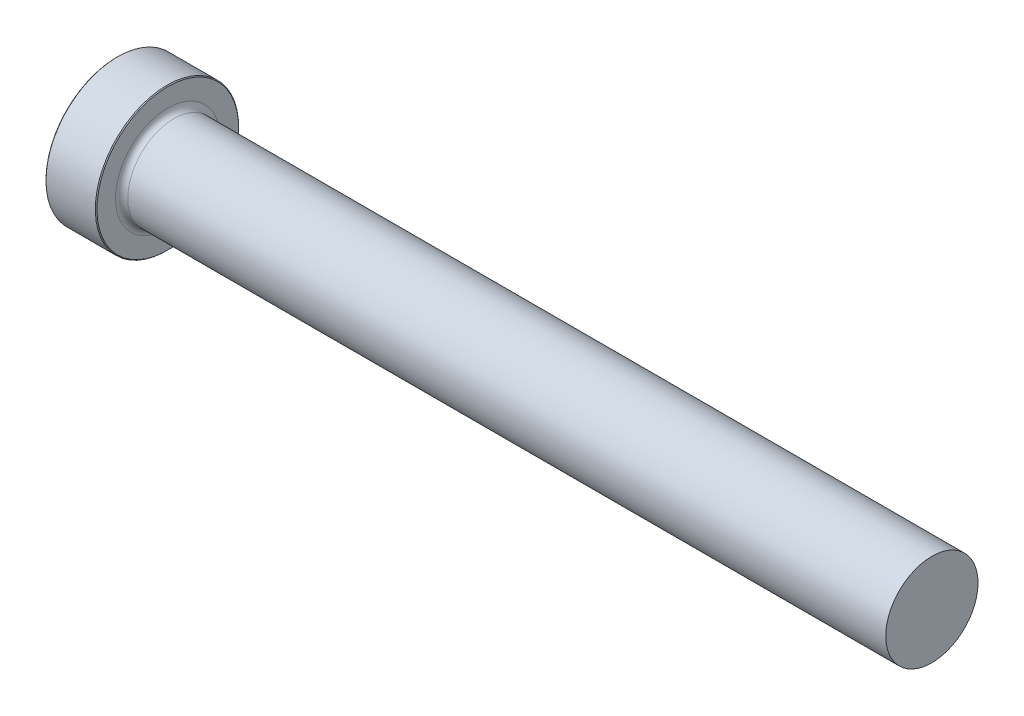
ISO-10303-21;
HEADER;
FILE_DESCRIPTION(('STEP AP214'),'2;1');
FILE_NAME('part.step','',(''),(''),'','','');
FILE_SCHEMA(('AUTOMOTIVE_DESIGN { 1 0 10303 214 1 1 1 1 }'));
ENDSEC;
DATA;
#1=APPLICATION_CONTEXT('core data for automotive mechanical design processes');
#2=APPLICATION_PROTOCOL_DEFINITION('international standard','automotive_design',2000,#1);
#3=PRODUCT_CONTEXT('',#1,'mechanical');
#4=PRODUCT('Part','Part','',(#3));
#5=PRODUCT_RELATED_PRODUCT_CATEGORY('part','',(#4));
#6=PRODUCT_DEFINITION_FORMATION('','',#4);
#7=PRODUCT_DEFINITION_CONTEXT('part definition',#1,'design');
#8=PRODUCT_DEFINITION('design','',#6,#7);
#9=PRODUCT_DEFINITION_SHAPE('','',#8);
#10=(LENGTH_UNIT() NAMED_UNIT(*) SI_UNIT(.MILLI.,.METRE.));
#11=(NAMED_UNIT(*) PLANE_ANGLE_UNIT() SI_UNIT($,.RADIAN.));
#12=(NAMED_UNIT(*) SI_UNIT($,.STERADIAN.) SOLID_ANGLE_UNIT());
#13=UNCERTAINTY_MEASURE_WITH_UNIT(LENGTH_MEASURE(1.E-05),#10,'distance_accuracy_value','');
#14=(GEOMETRIC_REPRESENTATION_CONTEXT(3) GLOBAL_UNCERTAINTY_ASSIGNED_CONTEXT((#13)) GLOBAL_UNIT_ASSIGNED_CONTEXT((#10,
#11,#12)) REPRESENTATION_CONTEXT('',''));
#15=CARTESIAN_POINT('',(0.,0.,0.));
#16=DIRECTION('',(0.,0.,1.));
#17=DIRECTION('',(1.,0.,0.));
#18=AXIS2_PLACEMENT_3D('',#15,#16,#17);
#19=CARTESIAN_POINT('',(101.6,5.75087749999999,0.));
#20=DIRECTION('',(1.,0.,0.));
#21=DIRECTION('',(0.,1.,0.));
#22=AXIS2_PLACEMENT_3D('',#19,#20,#21);
#23=PLANE('',#22);
#24=CARTESIAN_POINT('',(101.6,0.,0.));
#25=DIRECTION('',(1.,0.,0.));
#26=DIRECTION('',(0.,1.,0.));
#27=AXIS2_PLACEMENT_3D('',#24,#25,#26);
#28=CIRCLE('',#27,5.7508775);
#29=CARTESIAN_POINT('',(101.6,5.75087749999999,0.));
#30=VERTEX_POINT('',#29);
#31=EDGE_CURVE('E50',#30,#30,#28,.T.);
#32=ORIENTED_EDGE('',*,*,#31,.T.);
#33=EDGE_LOOP('',(#32));
#34=FACE_BOUND('',#33,.T.);
#35=ADVANCED_FACE('F30',(#34),#23,.T.);
#36=CARTESIAN_POINT('',(101.6,0.,0.));
#37=DIRECTION('',(1.,0.,0.));
#38=DIRECTION('',(0.,1.,0.));
#39=AXIS2_PLACEMENT_3D('',#36,#37,#38);
#40=CYLINDRICAL_SURFACE('',#39,5.7508775);
#41=CARTESIAN_POINT('',(7.11199999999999,0.,0.));
#42=DIRECTION('',(1.,0.,0.));
#43=DIRECTION('',(0.,1.,0.));
#44=AXIS2_PLACEMENT_3D('',#41,#42,#43);
#45=CIRCLE('',#44,5.75087749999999);
#46=CARTESIAN_POINT('',(7.11199999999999,5.75087749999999,0.));
#47=VERTEX_POINT('',#46);
#48=EDGE_CURVE('E53',#47,#47,#45,.T.);
#49=ORIENTED_EDGE('',*,*,#48,.T.);
#50=EDGE_LOOP('',(#49));
#51=FACE_BOUND('',#50,.T.);
#52=ORIENTED_EDGE('',*,*,#31,.F.);
#53=EDGE_LOOP('',(#52));
#54=FACE_BOUND('',#53,.T.);
#55=ADVANCED_FACE('F74',(#51,#54),#40,.T.);
#56=CARTESIAN_POINT('',(7.112,0.,0.));
#57=DIRECTION('',(1.,0.,0.));
#58=DIRECTION('',(0.,1.,0.));
#59=AXIS2_PLACEMENT_3D('',#56,#57,#58);
#60=TOROIDAL_SURFACE('',#59,6.51287749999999,0.762);
#61=CARTESIAN_POINT('',(6.34999999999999,0.,0.));
#62=DIRECTION('',(1.,0.,0.));
#63=DIRECTION('',(0.,1.,0.));
#64=AXIS2_PLACEMENT_3D('',#61,#62,#63);
#65=CIRCLE('',#64,6.51287749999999);
#66=CARTESIAN_POINT('',(6.34999999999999,6.51287749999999,0.));
#67=VERTEX_POINT('',#66);
#68=EDGE_CURVE('E56',#67,#67,#65,.T.);
#69=ORIENTED_EDGE('',*,*,#68,.T.);
#70=EDGE_LOOP('',(#69));
#71=FACE_BOUND('',#70,.T.);
#72=ORIENTED_EDGE('',*,*,#48,.F.);
#73=EDGE_LOOP('',(#72));
#74=FACE_BOUND('',#73,.T.);
#75=ADVANCED_FACE('F60',(#71,#74),#60,.F.);
#76=CARTESIAN_POINT('',(6.35,8.9296875,0.));
#77=DIRECTION('',(1.,0.,0.));
#78=DIRECTION('',(0.,1.,0.));
#79=AXIS2_PLACEMENT_3D('',#76,#77,#78);
#80=PLANE('',#79);
#81=CARTESIAN_POINT('',(6.35,0.,0.));
#82=DIRECTION('',(1.,0.,0.));
#83=DIRECTION('',(0.,1.,0.));
#84=AXIS2_PLACEMENT_3D('',#81,#82,#83);
#85=CIRCLE('',#84,8.82808750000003);
#86=CARTESIAN_POINT('',(6.35,8.82808750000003,0.));
#87=VERTEX_POINT('',#86);
#88=EDGE_CURVE('E10',#87,#87,#85,.T.);
#89=ORIENTED_EDGE('',*,*,#88,.T.);
#90=EDGE_LOOP('',(#89));
#91=FACE_BOUND('',#90,.T.);
#92=ORIENTED_EDGE('',*,*,#68,.F.);
#93=EDGE_LOOP('',(#92));
#94=FACE_BOUND('',#93,.T.);
#95=ADVANCED_FACE('F63',(#91,#94),#80,.T.);
#96=CARTESIAN_POINT('',(101.6,0.,0.));
#97=DIRECTION('',(1.,0.,0.));
#98=DIRECTION('',(0.,1.,0.));
#99=AXIS2_PLACEMENT_3D('',#96,#97,#98);
#100=CYLINDRICAL_SURFACE('',#99,8.9296875);
#101=CARTESIAN_POINT('',(0.101599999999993,0.,0.));
#102=DIRECTION('',(-1.,0.,0.));
#103=DIRECTION('',(0.,-1.,0.));
#104=AXIS2_PLACEMENT_3D('',#101,#102,#103);
#105=CIRCLE('',#104,8.9296875);
#106=CARTESIAN_POINT('',(0.101599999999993,-8.9296875,0.));
#107=VERTEX_POINT('',#106);
#108=EDGE_CURVE('E41',#107,#107,#105,.F.);
#109=ORIENTED_EDGE('',*,*,#108,.T.);
#110=EDGE_LOOP('',(#109));
#111=FACE_BOUND('',#110,.T.);
#112=CARTESIAN_POINT('',(6.24840000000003,0.,0.));
#113=DIRECTION('',(1.,0.,0.));
#114=DIRECTION('',(0.,1.,0.));
#115=AXIS2_PLACEMENT_3D('',#112,#113,#114);
#116=CIRCLE('',#115,8.9296875);
#117=CARTESIAN_POINT('',(6.24840000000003,8.9296875,0.));
#118=VERTEX_POINT('',#117);
#119=EDGE_CURVE('E45',#118,#118,#116,.F.);
#120=ORIENTED_EDGE('',*,*,#119,.T.);
#121=EDGE_LOOP('',(#120));
#122=FACE_BOUND('',#121,.T.);
#123=ADVANCED_FACE('F65',(#111,#122),#100,.T.);
#124=CARTESIAN_POINT('',(0.,0.,0.));
#125=DIRECTION('',(-1.,0.,0.));
#126=DIRECTION('',(0.,-1.,0.));
#127=AXIS2_PLACEMENT_3D('',#124,#125,#126);
#128=PLANE('',#127);
#129=CARTESIAN_POINT('',(0.,0.,0.));
#130=DIRECTION('',(-1.,0.,0.));
#131=DIRECTION('',(0.,-1.,0.));
#132=AXIS2_PLACEMENT_3D('',#129,#130,#131);
#133=CIRCLE('',#132,8.8280875);
#134=CARTESIAN_POINT('',(0.,-8.8280875,0.));
#135=VERTEX_POINT('',#134);
#136=EDGE_CURVE('E37',#135,#135,#133,.T.);
#137=ORIENTED_EDGE('',*,*,#136,.T.);
#138=EDGE_LOOP('',(#137));
#139=FACE_BOUND('',#138,.T.);
#140=ADVANCED_FACE('F71',(#139),#128,.T.);
#141=CARTESIAN_POINT('',(0.101599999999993,0.,0.));
#142=DIRECTION('',(1.,0.,0.));
#143=DIRECTION('',(0.,1.,0.));
#144=AXIS2_PLACEMENT_3D('',#141,#142,#143);
#145=CONICAL_SURFACE('',#144,8.9296875,0.785398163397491);
#146=ORIENTED_EDGE('',*,*,#136,.F.);
#147=EDGE_LOOP('',(#146));
#148=FACE_BOUND('',#147,.T.);
#149=ORIENTED_EDGE('',*,*,#108,.F.);
#150=EDGE_LOOP('',(#149));
#151=FACE_BOUND('',#150,.T.);
#152=ADVANCED_FACE('F84',(#148,#151),#145,.T.);
#153=CARTESIAN_POINT('',(6.34999999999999,0.,0.));
#154=DIRECTION('',(-1.,0.,0.));
#155=DIRECTION('',(0.,-1.,0.));
#156=AXIS2_PLACEMENT_3D('',#153,#154,#155);
#157=CONICAL_SURFACE('',#156,8.82808750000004,0.785398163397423);
#158=ORIENTED_EDGE('',*,*,#119,.F.);
#159=EDGE_LOOP('',(#158));
#160=FACE_BOUND('',#159,.T.);
#161=ORIENTED_EDGE('',*,*,#88,.F.);
#162=EDGE_LOOP('',(#161));
#163=FACE_BOUND('',#162,.T.);
#164=ADVANCED_FACE('F32',(#160,#163),#157,.T.);
#165=CLOSED_SHELL('',(#35,#55,#75,#95,#123,#140,#152,#164));
#166=MANIFOLD_SOLID_BREP('B2',#165);
#167=ADVANCED_BREP_SHAPE_REPRESENTATION('',(#18,#166),#14);
#168=SHAPE_DEFINITION_REPRESENTATION(#9,#167);
ENDSEC;
END-ISO-10303-21;
